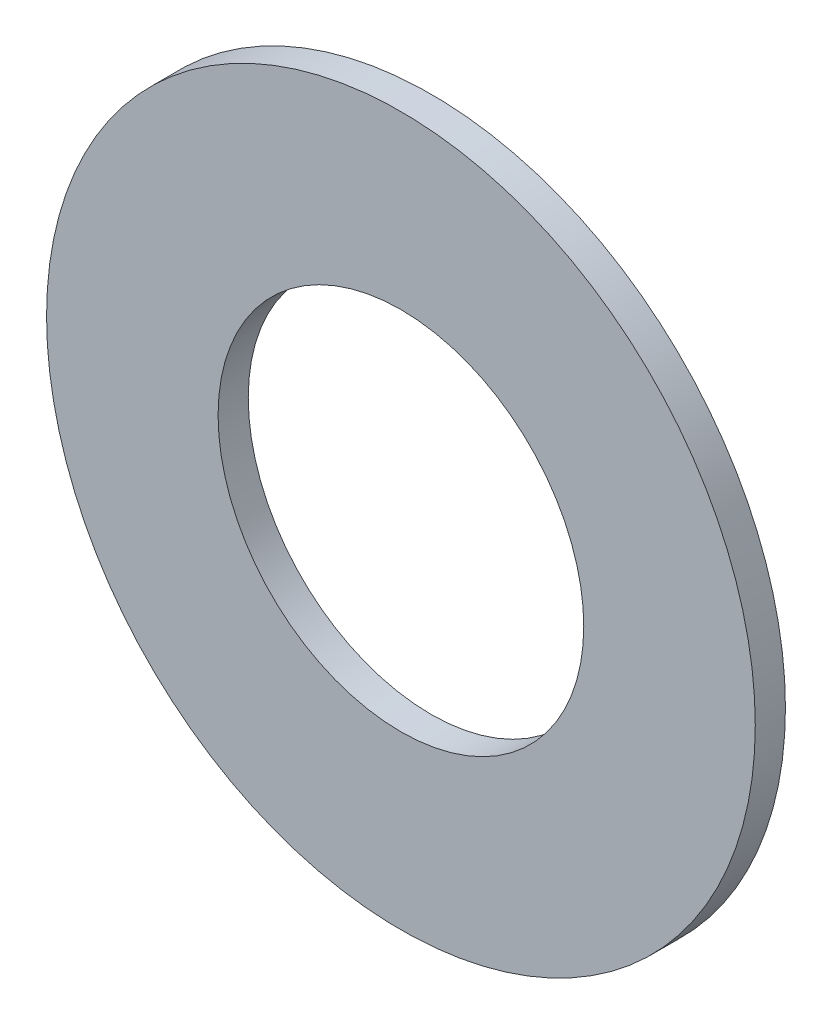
ISO-10303-21;
HEADER;
FILE_DESCRIPTION(('STEP AP214'),'2;1');
FILE_NAME('part.step','',(''),(''),'','','');
FILE_SCHEMA(('AUTOMOTIVE_DESIGN { 1 0 10303 214 1 1 1 1 }'));
ENDSEC;
DATA;
#1=APPLICATION_CONTEXT('core data for automotive mechanical design processes');
#2=APPLICATION_PROTOCOL_DEFINITION('international standard','automotive_design',2000,#1);
#3=PRODUCT_CONTEXT('',#1,'mechanical');
#4=PRODUCT('Part','Part','',(#3));
#5=PRODUCT_RELATED_PRODUCT_CATEGORY('part','',(#4));
#6=PRODUCT_DEFINITION_FORMATION('','',#4);
#7=PRODUCT_DEFINITION_CONTEXT('part definition',#1,'design');
#8=PRODUCT_DEFINITION('design','',#6,#7);
#9=PRODUCT_DEFINITION_SHAPE('','',#8);
#10=(LENGTH_UNIT() NAMED_UNIT(*) SI_UNIT(.MILLI.,.METRE.));
#11=(NAMED_UNIT(*) PLANE_ANGLE_UNIT() SI_UNIT($,.RADIAN.));
#12=(NAMED_UNIT(*) SI_UNIT($,.STERADIAN.) SOLID_ANGLE_UNIT());
#13=UNCERTAINTY_MEASURE_WITH_UNIT(LENGTH_MEASURE(1.E-05),#10,'distance_accuracy_value','');
#14=(GEOMETRIC_REPRESENTATION_CONTEXT(3) GLOBAL_UNCERTAINTY_ASSIGNED_CONTEXT((#13)) GLOBAL_UNIT_ASSIGNED_CONTEXT((#10,
#11,#12)) REPRESENTATION_CONTEXT('',''));
#15=CARTESIAN_POINT('',(0.,0.,0.));
#16=DIRECTION('',(0.,0.,1.));
#17=DIRECTION('',(1.,0.,0.));
#18=AXIS2_PLACEMENT_3D('',#15,#16,#17);
#19=CARTESIAN_POINT('',(0.,0.,1.016));
#20=DIRECTION('',(0.,0.,1.));
#21=DIRECTION('',(1.,0.,0.));
#22=AXIS2_PLACEMENT_3D('',#19,#20,#21);
#23=PLANE('',#22);
#24=CARTESIAN_POINT('',(0.,0.,1.016));
#25=DIRECTION('',(0.,0.,1.));
#26=DIRECTION('',(1.,0.,0.));
#27=AXIS2_PLACEMENT_3D('',#24,#25,#26);
#28=CIRCLE('',#27,11.938);
#29=CARTESIAN_POINT('',(11.938,0.,1.016));
#30=VERTEX_POINT('',#29);
#31=EDGE_CURVE('E10',#30,#30,#28,.T.);
#32=ORIENTED_EDGE('',*,*,#31,.T.);
#33=EDGE_LOOP('',(#32));
#34=FACE_BOUND('',#33,.T.);
#35=CARTESIAN_POINT('',(0.,0.,1.016));
#36=DIRECTION('',(0.,0.,1.));
#37=DIRECTION('',(1.,0.,0.));
#38=AXIS2_PLACEMENT_3D('',#35,#36,#37);
#39=CIRCLE('',#38,6.1595);
#40=CARTESIAN_POINT('',(6.1595,0.,1.016));
#41=VERTEX_POINT('',#40);
#42=EDGE_CURVE('E40',#41,#41,#39,.T.);
#43=ORIENTED_EDGE('',*,*,#42,.F.);
#44=EDGE_LOOP('',(#43));
#45=FACE_BOUND('',#44,.T.);
#46=ADVANCED_FACE('F29',(#34,#45),#23,.T.);
#47=CARTESIAN_POINT('',(0.,0.,0.));
#48=DIRECTION('',(0.,0.,1.));
#49=DIRECTION('',(1.,0.,0.));
#50=AXIS2_PLACEMENT_3D('',#47,#48,#49);
#51=PLANE('',#50);
#52=CARTESIAN_POINT('',(0.,0.,0.));
#53=DIRECTION('',(0.,0.,1.));
#54=DIRECTION('',(1.,0.,0.));
#55=AXIS2_PLACEMENT_3D('',#52,#53,#54);
#56=CIRCLE('',#55,11.938);
#57=CARTESIAN_POINT('',(11.938,0.,0.));
#58=VERTEX_POINT('',#57);
#59=EDGE_CURVE('E36',#58,#58,#56,.T.);
#60=ORIENTED_EDGE('',*,*,#59,.F.);
#61=EDGE_LOOP('',(#60));
#62=FACE_BOUND('',#61,.T.);
#63=CARTESIAN_POINT('',(0.,0.,0.));
#64=DIRECTION('',(0.,0.,1.));
#65=DIRECTION('',(1.,0.,0.));
#66=AXIS2_PLACEMENT_3D('',#63,#64,#65);
#67=CIRCLE('',#66,6.1595);
#68=CARTESIAN_POINT('',(6.1595,0.,0.));
#69=VERTEX_POINT('',#68);
#70=EDGE_CURVE('E44',#69,#69,#67,.T.);
#71=ORIENTED_EDGE('',*,*,#70,.T.);
#72=EDGE_LOOP('',(#71));
#73=FACE_BOUND('',#72,.T.);
#74=ADVANCED_FACE('F50',(#62,#73),#51,.F.);
#75=CARTESIAN_POINT('',(0.,0.,1.016));
#76=DIRECTION('',(0.,0.,-1.));
#77=DIRECTION('',(-1.,0.,0.));
#78=AXIS2_PLACEMENT_3D('',#75,#76,#77);
#79=CYLINDRICAL_SURFACE('',#78,11.938);
#80=ORIENTED_EDGE('',*,*,#31,.F.);
#81=EDGE_LOOP('',(#80));
#82=FACE_BOUND('',#81,.T.);
#83=ORIENTED_EDGE('',*,*,#59,.T.);
#84=EDGE_LOOP('',(#83));
#85=FACE_BOUND('',#84,.T.);
#86=ADVANCED_FACE('F31',(#82,#85),#79,.T.);
#87=CARTESIAN_POINT('',(0.,0.,1.016));
#88=DIRECTION('',(0.,0.,-1.));
#89=DIRECTION('',(-1.,0.,0.));
#90=AXIS2_PLACEMENT_3D('',#87,#88,#89);
#91=CYLINDRICAL_SURFACE('',#90,6.1595);
#92=ORIENTED_EDGE('',*,*,#42,.T.);
#93=EDGE_LOOP('',(#92));
#94=FACE_BOUND('',#93,.T.);
#95=ORIENTED_EDGE('',*,*,#70,.F.);
#96=EDGE_LOOP('',(#95));
#97=FACE_BOUND('',#96,.T.);
#98=ADVANCED_FACE('F52',(#94,#97),#91,.F.);
#99=CLOSED_SHELL('',(#46,#74,#86,#98));
#100=MANIFOLD_SOLID_BREP('B2',#99);
#101=ADVANCED_BREP_SHAPE_REPRESENTATION('',(#18,#100),#14);
#102=SHAPE_DEFINITION_REPRESENTATION(#9,#101);
ENDSEC;
END-ISO-10303-21;
